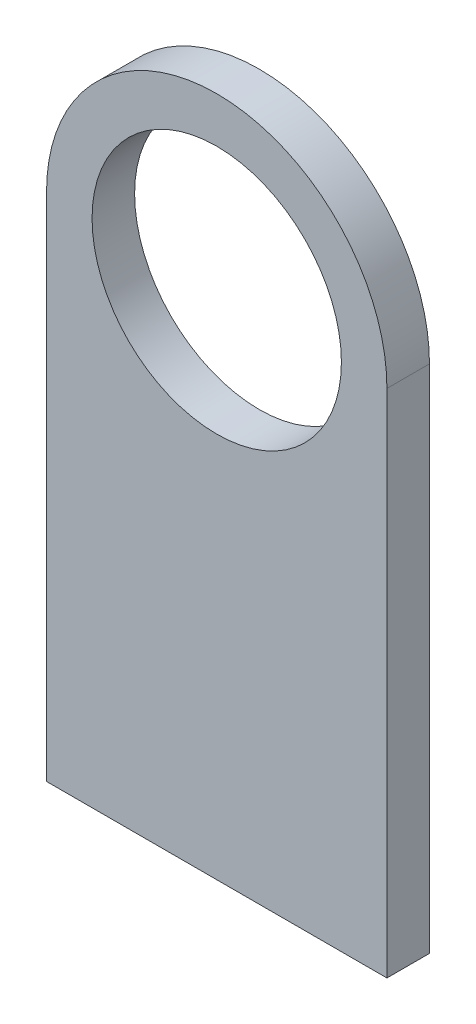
ISO-10303-21;
HEADER;
FILE_DESCRIPTION(('STEP AP214'),'2;1');
FILE_NAME('part.step','',(''),(''),'','','');
FILE_SCHEMA(('AUTOMOTIVE_DESIGN { 1 0 10303 214 1 1 1 1 }'));
ENDSEC;
DATA;
#1=APPLICATION_CONTEXT('core data for automotive mechanical design processes');
#2=APPLICATION_PROTOCOL_DEFINITION('international standard','automotive_design',2000,#1);
#3=PRODUCT_CONTEXT('',#1,'mechanical');
#4=PRODUCT('Part','Part','',(#3));
#5=PRODUCT_RELATED_PRODUCT_CATEGORY('part','',(#4));
#6=PRODUCT_DEFINITION_FORMATION('','',#4);
#7=PRODUCT_DEFINITION_CONTEXT('part definition',#1,'design');
#8=PRODUCT_DEFINITION('design','',#6,#7);
#9=PRODUCT_DEFINITION_SHAPE('','',#8);
#10=(LENGTH_UNIT() NAMED_UNIT(*) SI_UNIT(.MILLI.,.METRE.));
#11=(NAMED_UNIT(*) PLANE_ANGLE_UNIT() SI_UNIT($,.RADIAN.));
#12=(NAMED_UNIT(*) SI_UNIT($,.STERADIAN.) SOLID_ANGLE_UNIT());
#13=UNCERTAINTY_MEASURE_WITH_UNIT(LENGTH_MEASURE(1.E-05),#10,'distance_accuracy_value','');
#14=(GEOMETRIC_REPRESENTATION_CONTEXT(3) GLOBAL_UNCERTAINTY_ASSIGNED_CONTEXT((#13)) GLOBAL_UNIT_ASSIGNED_CONTEXT((#10,
#11,#12)) REPRESENTATION_CONTEXT('',''));
#15=CARTESIAN_POINT('',(0.,0.,0.));
#16=DIRECTION('',(0.,0.,1.));
#17=DIRECTION('',(1.,0.,0.));
#18=AXIS2_PLACEMENT_3D('',#15,#16,#17);
#19=CARTESIAN_POINT('',(39.2900572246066,20.4489985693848,9.525));
#20=DIRECTION('',(1.,0.,0.));
#21=DIRECTION('',(0.,0.,-1.));
#22=AXIS2_PLACEMENT_3D('',#19,#20,#21);
#23=PLANE('',#22);
#24=DIRECTION('',(0.,-1.,0.));
#25=VECTOR('',#24,1.);
#26=CARTESIAN_POINT('',(39.2900572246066,20.4489985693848,0.));
#27=LINE('',#26,#25);
#28=CARTESIAN_POINT('',(39.2900572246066,58.5489985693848,0.));
#29=VERTEX_POINT('',#28);
#30=CARTESIAN_POINT('',(39.2900572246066,-55.7510014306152,0.));
#31=VERTEX_POINT('',#30);
#32=EDGE_CURVE('E86',#29,#31,#27,.T.);
#33=ORIENTED_EDGE('',*,*,#32,.F.);
#34=DIRECTION('',(0.,0.,-1.));
#35=VECTOR('',#34,1.);
#36=CARTESIAN_POINT('',(39.2900572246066,58.5489985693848,9.525));
#37=LINE('',#36,#35);
#38=CARTESIAN_POINT('',(39.2900572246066,58.5489985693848,9.525));
#39=VERTEX_POINT('',#38);
#40=EDGE_CURVE('E11',#39,#29,#37,.T.);
#41=ORIENTED_EDGE('',*,*,#40,.F.);
#42=DIRECTION('',(0.,-1.,0.));
#43=VECTOR('',#42,1.);
#44=CARTESIAN_POINT('',(39.2900572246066,20.4489985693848,9.525));
#45=LINE('',#44,#43);
#46=CARTESIAN_POINT('',(39.2900572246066,-55.7510014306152,9.525));
#47=VERTEX_POINT('',#46);
#48=EDGE_CURVE('E100',#39,#47,#45,.T.);
#49=ORIENTED_EDGE('',*,*,#48,.T.);
#50=DIRECTION('',(0.,0.,-1.));
#51=VECTOR('',#50,1.);
#52=CARTESIAN_POINT('',(39.2900572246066,-55.7510014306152,9.525));
#53=LINE('',#52,#51);
#54=EDGE_CURVE('E46',#47,#31,#53,.T.);
#55=ORIENTED_EDGE('',*,*,#54,.T.);
#56=EDGE_LOOP('',(#33,#41,#49,#55));
#57=FACE_BOUND('',#56,.T.);
#58=ADVANCED_FACE('F31',(#57),#23,.T.);
#59=CARTESIAN_POINT('',(1.19005722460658,58.5489985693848,9.525));
#60=DIRECTION('',(0.,0.,-1.));
#61=DIRECTION('',(-1.,0.,0.));
#62=AXIS2_PLACEMENT_3D('',#59,#60,#61);
#63=CYLINDRICAL_SURFACE('',#62,38.1);
#64=CARTESIAN_POINT('',(1.19005722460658,58.5489985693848,0.));
#65=DIRECTION('',(0.,0.,-1.));
#66=DIRECTION('',(-1.,0.,0.));
#67=AXIS2_PLACEMENT_3D('',#64,#65,#66);
#68=CIRCLE('',#67,38.1);
#69=CARTESIAN_POINT('',(-36.9099427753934,58.5489985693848,0.));
#70=VERTEX_POINT('',#69);
#71=EDGE_CURVE('E76',#29,#70,#68,.F.);
#72=ORIENTED_EDGE('',*,*,#71,.T.);
#73=DIRECTION('',(0.,0.,-1.));
#74=VECTOR('',#73,1.);
#75=CARTESIAN_POINT('',(-36.9099427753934,58.5489985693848,9.525));
#76=LINE('',#75,#74);
#77=CARTESIAN_POINT('',(-36.9099427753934,58.5489985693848,9.525));
#78=VERTEX_POINT('',#77);
#79=EDGE_CURVE('E39',#78,#70,#76,.T.);
#80=ORIENTED_EDGE('',*,*,#79,.F.);
#81=CARTESIAN_POINT('',(1.19005722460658,58.5489985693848,9.525));
#82=DIRECTION('',(0.,0.,-1.));
#83=DIRECTION('',(-1.,0.,0.));
#84=AXIS2_PLACEMENT_3D('',#81,#82,#83);
#85=CIRCLE('',#84,38.1);
#86=EDGE_CURVE('E78',#39,#78,#85,.F.);
#87=ORIENTED_EDGE('',*,*,#86,.F.);
#88=ORIENTED_EDGE('',*,*,#40,.T.);
#89=EDGE_LOOP('',(#72,#80,#87,#88));
#90=FACE_BOUND('',#89,.T.);
#91=ADVANCED_FACE('F74',(#90),#63,.T.);
#92=CARTESIAN_POINT('',(-36.9099427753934,20.4489985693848,9.525));
#93=DIRECTION('',(-1.,0.,0.));
#94=DIRECTION('',(0.,0.,1.));
#95=AXIS2_PLACEMENT_3D('',#92,#93,#94);
#96=PLANE('',#95);
#97=DIRECTION('',(0.,1.,0.));
#98=VECTOR('',#97,1.);
#99=CARTESIAN_POINT('',(-36.9099427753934,20.4489985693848,0.));
#100=LINE('',#99,#98);
#101=CARTESIAN_POINT('',(-36.9099427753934,-55.7510014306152,0.));
#102=VERTEX_POINT('',#101);
#103=EDGE_CURVE('E87',#102,#70,#100,.T.);
#104=ORIENTED_EDGE('',*,*,#103,.F.);
#105=DIRECTION('',(0.,0.,-1.));
#106=VECTOR('',#105,1.);
#107=CARTESIAN_POINT('',(-36.9099427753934,-55.7510014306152,9.525));
#108=LINE('',#107,#106);
#109=CARTESIAN_POINT('',(-36.9099427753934,-55.7510014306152,9.525));
#110=VERTEX_POINT('',#109);
#111=EDGE_CURVE('E54',#110,#102,#108,.T.);
#112=ORIENTED_EDGE('',*,*,#111,.F.);
#113=DIRECTION('',(0.,1.,0.));
#114=VECTOR('',#113,1.);
#115=CARTESIAN_POINT('',(-36.9099427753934,20.4489985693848,9.525));
#116=LINE('',#115,#114);
#117=EDGE_CURVE('E103',#110,#78,#116,.T.);
#118=ORIENTED_EDGE('',*,*,#117,.T.);
#119=ORIENTED_EDGE('',*,*,#79,.T.);
#120=EDGE_LOOP('',(#104,#112,#118,#119));
#121=FACE_BOUND('',#120,.T.);
#122=ADVANCED_FACE('F108',(#121),#96,.T.);
#123=CARTESIAN_POINT('',(1.19005722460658,58.5489985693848,9.525));
#124=DIRECTION('',(0.,0.,-1.));
#125=DIRECTION('',(-1.,0.,0.));
#126=AXIS2_PLACEMENT_3D('',#123,#124,#125);
#127=CYLINDRICAL_SURFACE('',#126,27.90825);
#128=CARTESIAN_POINT('',(1.19005722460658,58.5489985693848,9.525));
#129=DIRECTION('',(0.,0.,-1.));
#130=DIRECTION('',(-1.,0.,0.));
#131=AXIS2_PLACEMENT_3D('',#128,#129,#130);
#132=CIRCLE('',#131,27.90825);
#133=CARTESIAN_POINT('',(-26.7181927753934,58.5489985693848,9.525));
#134=VERTEX_POINT('',#133);
#135=EDGE_CURVE('E97',#134,#134,#132,.T.);
#136=CARTESIAN_POINT('',(1.19005722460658,58.5489985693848,0.));
#137=DIRECTION('',(0.,0.,-1.));
#138=DIRECTION('',(-1.,0.,0.));
#139=AXIS2_PLACEMENT_3D('',#136,#137,#138);
#140=CIRCLE('',#139,27.90825);
#141=CARTESIAN_POINT('',(-26.7181927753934,58.5489985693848,0.));
#142=VERTEX_POINT('',#141);
#143=EDGE_CURVE('E89',#142,#142,#140,.T.);
#144=CARTESIAN_POINT('',(-26.7181927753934,58.5489985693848,9.525));
#145=CARTESIAN_POINT('',(-26.7181927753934,58.5489985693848,9.42578125));
#146=CARTESIAN_POINT('',(-26.7181927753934,58.5489985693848,9.3265625));
#147=CARTESIAN_POINT('',(-26.7181927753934,58.5489985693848,9.128125));
#148=CARTESIAN_POINT('',(-26.7181927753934,58.5489985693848,9.02890625));
#149=CARTESIAN_POINT('',(-26.7181927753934,58.5489985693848,8.83046875));
#150=CARTESIAN_POINT('',(-26.7181927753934,58.5489985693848,8.73125));
#151=CARTESIAN_POINT('',(-26.7181927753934,58.5489985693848,8.5328125));
#152=CARTESIAN_POINT('',(-26.7181927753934,58.5489985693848,8.43359375));
#153=CARTESIAN_POINT('',(-26.7181927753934,58.5489985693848,8.23515625));
#154=CARTESIAN_POINT('',(-26.7181927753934,58.5489985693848,8.1359375));
#155=CARTESIAN_POINT('',(-26.7181927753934,58.5489985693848,7.9375));
#156=CARTESIAN_POINT('',(-26.7181927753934,58.5489985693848,7.83828125));
#157=CARTESIAN_POINT('',(-26.7181927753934,58.5489985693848,7.63984375));
#158=CARTESIAN_POINT('',(-26.7181927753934,58.5489985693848,7.540625));
#159=CARTESIAN_POINT('',(-26.7181927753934,58.5489985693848,7.3421875));
#160=CARTESIAN_POINT('',(-26.7181927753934,58.5489985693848,7.24296875));
#161=CARTESIAN_POINT('',(-26.7181927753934,58.5489985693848,7.04453125));
#162=CARTESIAN_POINT('',(-26.7181927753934,58.5489985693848,6.9453125));
#163=CARTESIAN_POINT('',(-26.7181927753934,58.5489985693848,6.746875));
#164=CARTESIAN_POINT('',(-26.7181927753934,58.5489985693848,6.64765625));
#165=CARTESIAN_POINT('',(-26.7181927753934,58.5489985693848,6.44921875));
#166=CARTESIAN_POINT('',(-26.7181927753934,58.5489985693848,6.35));
#167=CARTESIAN_POINT('',(-26.7181927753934,58.5489985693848,6.1515625));
#168=CARTESIAN_POINT('',(-26.7181927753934,58.5489985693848,6.05234375));
#169=CARTESIAN_POINT('',(-26.7181927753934,58.5489985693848,5.85390625));
#170=CARTESIAN_POINT('',(-26.7181927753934,58.5489985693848,5.7546875));
#171=CARTESIAN_POINT('',(-26.7181927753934,58.5489985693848,5.55625));
#172=CARTESIAN_POINT('',(-26.7181927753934,58.5489985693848,5.45703125));
#173=CARTESIAN_POINT('',(-26.7181927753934,58.5489985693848,5.25859375));
#174=CARTESIAN_POINT('',(-26.7181927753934,58.5489985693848,5.159375));
#175=CARTESIAN_POINT('',(-26.7181927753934,58.5489985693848,4.9609375));
#176=CARTESIAN_POINT('',(-26.7181927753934,58.5489985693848,4.86171875));
#177=CARTESIAN_POINT('',(-26.7181927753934,58.5489985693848,4.66328125));
#178=CARTESIAN_POINT('',(-26.7181927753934,58.5489985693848,4.5640625));
#179=CARTESIAN_POINT('',(-26.7181927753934,58.5489985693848,4.365625));
#180=CARTESIAN_POINT('',(-26.7181927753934,58.5489985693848,4.26640625));
#181=CARTESIAN_POINT('',(-26.7181927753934,58.5489985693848,4.06796875));
#182=CARTESIAN_POINT('',(-26.7181927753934,58.5489985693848,3.96875));
#183=CARTESIAN_POINT('',(-26.7181927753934,58.5489985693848,3.7703125));
#184=CARTESIAN_POINT('',(-26.7181927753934,58.5489985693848,3.67109375));
#185=CARTESIAN_POINT('',(-26.7181927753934,58.5489985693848,3.47265625));
#186=CARTESIAN_POINT('',(-26.7181927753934,58.5489985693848,3.3734375));
#187=CARTESIAN_POINT('',(-26.7181927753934,58.5489985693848,3.175));
#188=CARTESIAN_POINT('',(-26.7181927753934,58.5489985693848,3.07578125));
#189=CARTESIAN_POINT('',(-26.7181927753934,58.5489985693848,2.87734375));
#190=CARTESIAN_POINT('',(-26.7181927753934,58.5489985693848,2.778125));
#191=CARTESIAN_POINT('',(-26.7181927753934,58.5489985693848,2.5796875));
#192=CARTESIAN_POINT('',(-26.7181927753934,58.5489985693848,2.48046875));
#193=CARTESIAN_POINT('',(-26.7181927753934,58.5489985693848,2.28203125));
#194=CARTESIAN_POINT('',(-26.7181927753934,58.5489985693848,2.1828125));
#195=CARTESIAN_POINT('',(-26.7181927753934,58.5489985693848,1.984375));
#196=CARTESIAN_POINT('',(-26.7181927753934,58.5489985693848,1.88515625));
#197=CARTESIAN_POINT('',(-26.7181927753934,58.5489985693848,1.68671875));
#198=CARTESIAN_POINT('',(-26.7181927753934,58.5489985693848,1.5875));
#199=CARTESIAN_POINT('',(-26.7181927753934,58.5489985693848,1.3890625));
#200=CARTESIAN_POINT('',(-26.7181927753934,58.5489985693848,1.28984375));
#201=CARTESIAN_POINT('',(-26.7181927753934,58.5489985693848,1.09140625));
#202=CARTESIAN_POINT('',(-26.7181927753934,58.5489985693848,0.992187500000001));
#203=CARTESIAN_POINT('',(-26.7181927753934,58.5489985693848,0.793750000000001));
#204=CARTESIAN_POINT('',(-26.7181927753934,58.5489985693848,0.69453125));
#205=CARTESIAN_POINT('',(-26.7181927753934,58.5489985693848,0.49609375));
#206=CARTESIAN_POINT('',(-26.7181927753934,58.5489985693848,0.396875));
#207=CARTESIAN_POINT('',(-26.7181927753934,58.5489985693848,0.1984375));
#208=CARTESIAN_POINT('',(-26.7181927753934,58.5489985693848,0.0992187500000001));
#209=CARTESIAN_POINT('',(-26.7181927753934,58.5489985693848,0.));
#210=B_SPLINE_CURVE_WITH_KNOTS('',3,(#144,#145,#146,#147,#148,#149,#150,#151,#152,#153,#154,
#155,#156,#157,#158,#159,#160,#161,#162,#163,#164,#165,#166,#167,#168,#169,#170,#171,#172,#173,
#174,#175,#176,#177,#178,#179,#180,#181,#182,#183,#184,#185,#186,#187,#188,#189,#190,#191,#192,
#193,#194,#195,#196,#197,#198,#199,#200,#201,#202,#203,#204,#205,#206,#207,#208,#209),
.UNSPECIFIED.,.F.,.F.,(4,2,2,2,2,2,2,2,2,2,2,2,2,2,2,2,2,2,2,2,2,2,2,2,2,2,2,2,2,2,2,2,4),(0.,
0.297656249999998,0.595312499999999,0.892968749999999,1.190625,1.48828125,1.7859375,2.08359375,
2.38125,2.67890625,2.9765625,3.27421875,3.571875,3.86953125,4.1671875,4.46484375,4.7625,
5.06015625,5.3578125,5.65546875,5.953125,6.25078125,6.5484375,6.84609375,7.14375,7.44140625,
7.7390625,8.03671875,8.334375,8.63203125,8.9296875,9.22734375,9.525),.UNSPECIFIED.);
#211=EDGE_CURVE('BSEAM33',#134,#142,#210,.T.);
#212=ORIENTED_EDGE('',*,*,#135,.F.);
#213=ORIENTED_EDGE('',*,*,#143,.T.);
#214=ORIENTED_EDGE('',*,*,#211,.T.);
#215=ORIENTED_EDGE('',*,*,#211,.F.);
#216=EDGE_LOOP('',(#212,#214,#213,#215));
#217=FACE_BOUND('',#216,.T.);
#218=ADVANCED_FACE('F33',(#217),#127,.F.);
#219=CARTESIAN_POINT('',(-131.482420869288,-55.7510014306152,9.525));
#220=DIRECTION('',(0.,-1.,0.));
#221=DIRECTION('',(0.,0.,-1.));
#222=AXIS2_PLACEMENT_3D('',#219,#220,#221);
#223=PLANE('',#222);
#224=DIRECTION('',(-1.,0.,0.));
#225=VECTOR('',#224,1.);
#226=CARTESIAN_POINT('',(-131.482420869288,-55.7510014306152,0.));
#227=LINE('',#226,#225);
#228=EDGE_CURVE('E95',#31,#102,#227,.T.);
#229=ORIENTED_EDGE('',*,*,#228,.F.);
#230=ORIENTED_EDGE('',*,*,#54,.F.);
#231=DIRECTION('',(-1.,0.,0.));
#232=VECTOR('',#231,1.);
#233=CARTESIAN_POINT('',(-131.482420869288,-55.7510014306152,9.525));
#234=LINE('',#233,#232);
#235=EDGE_CURVE('E105',#47,#110,#234,.T.);
#236=ORIENTED_EDGE('',*,*,#235,.T.);
#237=ORIENTED_EDGE('',*,*,#111,.T.);
#238=EDGE_LOOP('',(#229,#230,#236,#237));
#239=FACE_BOUND('',#238,.T.);
#240=ADVANCED_FACE('F112',(#239),#223,.T.);
#241=CARTESIAN_POINT('',(-131.482420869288,20.4489985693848,9.525));
#242=DIRECTION('',(0.,0.,-1.));
#243=DIRECTION('',(-1.,0.,0.));
#244=AXIS2_PLACEMENT_3D('',#241,#242,#243);
#245=PLANE('',#244);
#246=ORIENTED_EDGE('',*,*,#135,.T.);
#247=EDGE_LOOP('',(#246));
#248=FACE_BOUND('',#247,.T.);
#249=ORIENTED_EDGE('',*,*,#48,.F.);
#250=ORIENTED_EDGE('',*,*,#86,.T.);
#251=ORIENTED_EDGE('',*,*,#117,.F.);
#252=ORIENTED_EDGE('',*,*,#235,.F.);
#253=EDGE_LOOP('',(#249,#250,#251,#252));
#254=FACE_BOUND('',#253,.T.);
#255=ADVANCED_FACE('F111',(#248,#254),#245,.F.);
#256=CARTESIAN_POINT('',(-131.482420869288,20.4489985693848,0.));
#257=DIRECTION('',(0.,0.,-1.));
#258=DIRECTION('',(-1.,0.,0.));
#259=AXIS2_PLACEMENT_3D('',#256,#257,#258);
#260=PLANE('',#259);
#261=ORIENTED_EDGE('',*,*,#143,.F.);
#262=EDGE_LOOP('',(#261));
#263=FACE_BOUND('',#262,.T.);
#264=ORIENTED_EDGE('',*,*,#32,.T.);
#265=ORIENTED_EDGE('',*,*,#228,.T.);
#266=ORIENTED_EDGE('',*,*,#103,.T.);
#267=ORIENTED_EDGE('',*,*,#71,.F.);
#268=EDGE_LOOP('',(#264,#265,#266,#267));
#269=FACE_BOUND('',#268,.T.);
#270=ADVANCED_FACE('F84',(#263,#269),#260,.T.);
#271=CLOSED_SHELL('',(#58,#91,#122,#218,#240,#255,#270));
#272=MANIFOLD_SOLID_BREP('B2',#271);
#273=ADVANCED_BREP_SHAPE_REPRESENTATION('',(#18,#272),#14);
#274=SHAPE_DEFINITION_REPRESENTATION(#9,#273);
ENDSEC;
END-ISO-10303-21;
